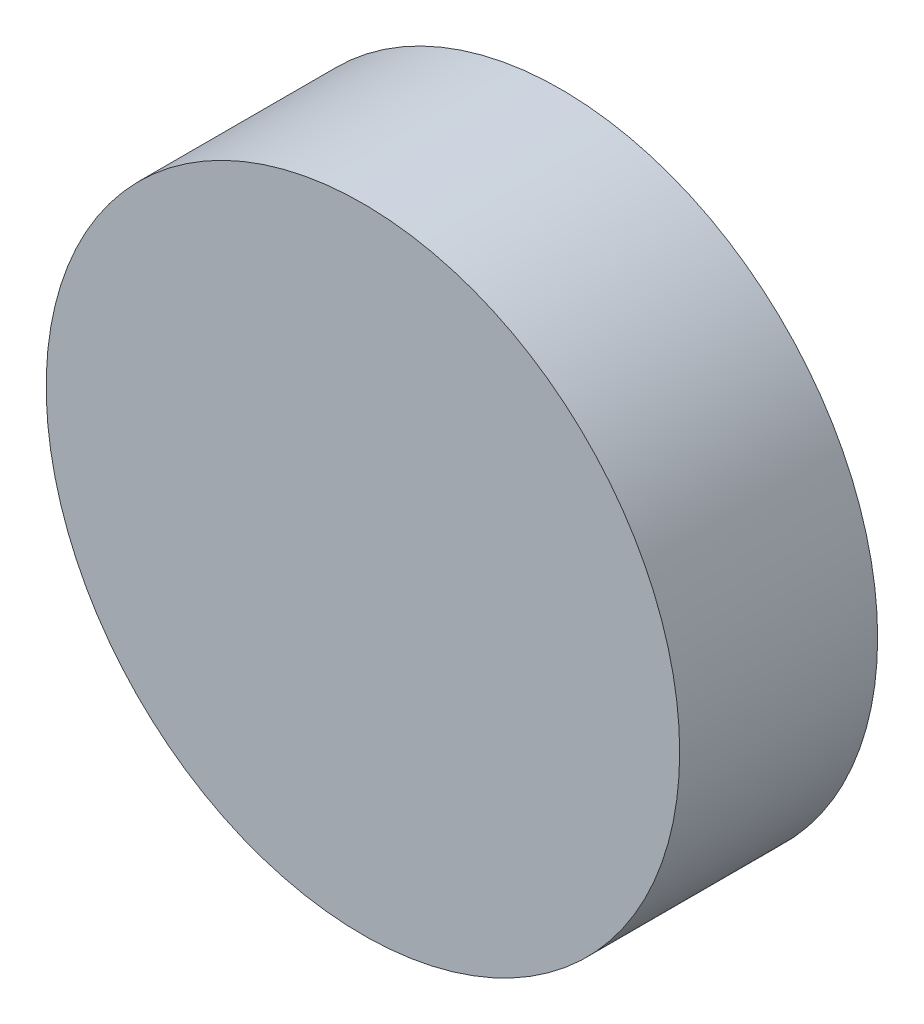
ISO-10303-21;
HEADER;
FILE_DESCRIPTION(('STEP AP214'),'2;1');
FILE_NAME('part.step','',(''),(''),'','','');
FILE_SCHEMA(('AUTOMOTIVE_DESIGN { 1 0 10303 214 1 1 1 1 }'));
ENDSEC;
DATA;
#1=APPLICATION_CONTEXT('core data for automotive mechanical design processes');
#2=APPLICATION_PROTOCOL_DEFINITION('international standard','automotive_design',2000,#1);
#3=PRODUCT_CONTEXT('',#1,'mechanical');
#4=PRODUCT('Part','Part','',(#3));
#5=PRODUCT_RELATED_PRODUCT_CATEGORY('part','',(#4));
#6=PRODUCT_DEFINITION_FORMATION('','',#4);
#7=PRODUCT_DEFINITION_CONTEXT('part definition',#1,'design');
#8=PRODUCT_DEFINITION('design','',#6,#7);
#9=PRODUCT_DEFINITION_SHAPE('','',#8);
#10=(LENGTH_UNIT() NAMED_UNIT(*) SI_UNIT(.MILLI.,.METRE.));
#11=(NAMED_UNIT(*) PLANE_ANGLE_UNIT() SI_UNIT($,.RADIAN.));
#12=(NAMED_UNIT(*) SI_UNIT($,.STERADIAN.) SOLID_ANGLE_UNIT());
#13=UNCERTAINTY_MEASURE_WITH_UNIT(LENGTH_MEASURE(1.E-05),#10,'distance_accuracy_value','');
#14=(GEOMETRIC_REPRESENTATION_CONTEXT(3) GLOBAL_UNCERTAINTY_ASSIGNED_CONTEXT((#13)) GLOBAL_UNIT_ASSIGNED_CONTEXT((#10,
#11,#12)) REPRESENTATION_CONTEXT('',''));
#15=CARTESIAN_POINT('',(0.,0.,0.));
#16=DIRECTION('',(0.,0.,1.));
#17=DIRECTION('',(1.,0.,0.));
#18=AXIS2_PLACEMENT_3D('',#15,#16,#17);
#19=CARTESIAN_POINT('',(0.,0.,50.));
#20=DIRECTION('',(0.,0.,-1.));
#21=DIRECTION('',(-1.,0.,0.));
#22=AXIS2_PLACEMENT_3D('',#19,#20,#21);
#23=CYLINDRICAL_SURFACE('',#22,80.);
#24=CARTESIAN_POINT('',(0.,0.,50.));
#25=DIRECTION('',(0.,0.,1.));
#26=DIRECTION('',(1.,0.,0.));
#27=AXIS2_PLACEMENT_3D('',#24,#25,#26);
#28=CIRCLE('',#27,80.);
#29=CARTESIAN_POINT('',(80.,0.,50.));
#30=VERTEX_POINT('',#29);
#31=EDGE_CURVE('E10',#30,#30,#28,.T.);
#32=ORIENTED_EDGE('',*,*,#31,.F.);
#33=EDGE_LOOP('',(#32));
#34=FACE_BOUND('',#33,.T.);
#35=CARTESIAN_POINT('',(0.,0.,0.));
#36=DIRECTION('',(0.,0.,1.));
#37=DIRECTION('',(1.,0.,0.));
#38=AXIS2_PLACEMENT_3D('',#35,#36,#37);
#39=CIRCLE('',#38,80.);
#40=CARTESIAN_POINT('',(80.,0.,0.));
#41=VERTEX_POINT('',#40);
#42=EDGE_CURVE('E40',#41,#41,#39,.T.);
#43=ORIENTED_EDGE('',*,*,#42,.T.);
#44=EDGE_LOOP('',(#43));
#45=FACE_BOUND('',#44,.T.);
#46=ADVANCED_FACE('F37',(#34,#45),#23,.T.);
#47=CARTESIAN_POINT('',(0.,0.,50.));
#48=DIRECTION('',(0.,0.,1.));
#49=DIRECTION('',(1.,0.,0.));
#50=AXIS2_PLACEMENT_3D('',#47,#48,#49);
#51=PLANE('',#50);
#52=ORIENTED_EDGE('',*,*,#31,.T.);
#53=EDGE_LOOP('',(#52));
#54=FACE_BOUND('',#53,.T.);
#55=ADVANCED_FACE('F54',(#54),#51,.T.);
#56=CARTESIAN_POINT('',(0.,0.,0.));
#57=DIRECTION('',(0.,0.,1.));
#58=DIRECTION('',(1.,0.,0.));
#59=AXIS2_PLACEMENT_3D('',#56,#57,#58);
#60=PLANE('',#59);
#61=ORIENTED_EDGE('',*,*,#42,.F.);
#62=EDGE_LOOP('',(#61));
#63=FACE_BOUND('',#62,.T.);
#64=ADVANCED_FACE('F52',(#63),#60,.F.);
#65=CLOSED_SHELL('',(#46,#55,#64));
#66=MANIFOLD_SOLID_BREP('B2',#65);
#67=ADVANCED_BREP_SHAPE_REPRESENTATION('',(#18,#66),#14);
#68=SHAPE_DEFINITION_REPRESENTATION(#9,#67);
ENDSEC;
END-ISO-10303-21;
